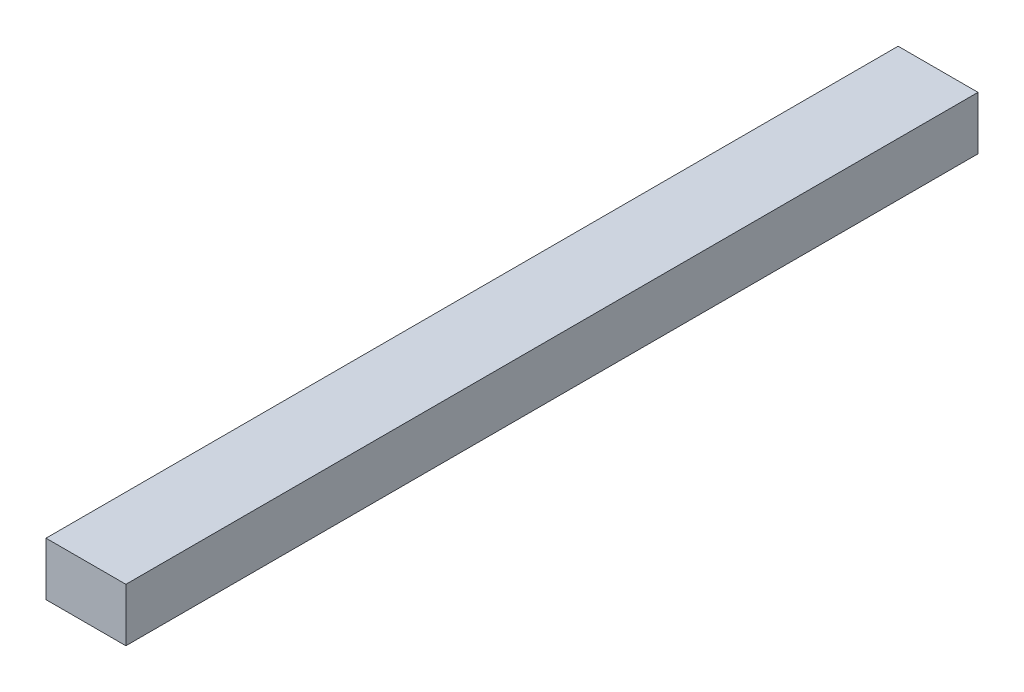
ISO-10303-21;
HEADER;
FILE_DESCRIPTION(('STEP AP214'),'2;1');
FILE_NAME('part.step','',(''),(''),'','','');
FILE_SCHEMA(('AUTOMOTIVE_DESIGN { 1 0 10303 214 1 1 1 1 }'));
ENDSEC;
DATA;
#1=APPLICATION_CONTEXT('core data for automotive mechanical design processes');
#2=APPLICATION_PROTOCOL_DEFINITION('international standard','automotive_design',2000,#1);
#3=PRODUCT_CONTEXT('',#1,'mechanical');
#4=PRODUCT('Part','Part','',(#3));
#5=PRODUCT_RELATED_PRODUCT_CATEGORY('part','',(#4));
#6=PRODUCT_DEFINITION_FORMATION('','',#4);
#7=PRODUCT_DEFINITION_CONTEXT('part definition',#1,'design');
#8=PRODUCT_DEFINITION('design','',#6,#7);
#9=PRODUCT_DEFINITION_SHAPE('','',#8);
#10=(LENGTH_UNIT() NAMED_UNIT(*) SI_UNIT(.MILLI.,.METRE.));
#11=(NAMED_UNIT(*) PLANE_ANGLE_UNIT() SI_UNIT($,.RADIAN.));
#12=(NAMED_UNIT(*) SI_UNIT($,.STERADIAN.) SOLID_ANGLE_UNIT());
#13=UNCERTAINTY_MEASURE_WITH_UNIT(LENGTH_MEASURE(1.E-05),#10,'distance_accuracy_value','');
#14=(GEOMETRIC_REPRESENTATION_CONTEXT(3) GLOBAL_UNCERTAINTY_ASSIGNED_CONTEXT((#13)) GLOBAL_UNIT_ASSIGNED_CONTEXT((#10,
#11,#12)) REPRESENTATION_CONTEXT('',''));
#15=CARTESIAN_POINT('',(0.,0.,0.));
#16=DIRECTION('',(0.,0.,1.));
#17=DIRECTION('',(1.,0.,0.));
#18=AXIS2_PLACEMENT_3D('',#15,#16,#17);
#19=CARTESIAN_POINT('',(3.,2.,32.));
#20=DIRECTION('',(-1.,0.,0.));
#21=DIRECTION('',(0.,0.,1.));
#22=AXIS2_PLACEMENT_3D('',#19,#20,#21);
#23=PLANE('',#22);
#24=DIRECTION('',(0.,1.,0.));
#25=VECTOR('',#24,1.);
#26=CARTESIAN_POINT('',(3.,2.,-32.));
#27=LINE('',#26,#25);
#28=CARTESIAN_POINT('',(3.,-2.,-32.));
#29=VERTEX_POINT('',#28);
#30=CARTESIAN_POINT('',(3.,2.,-32.));
#31=VERTEX_POINT('',#30);
#32=EDGE_CURVE('E102',#29,#31,#27,.T.);
#33=ORIENTED_EDGE('',*,*,#32,.T.);
#34=DIRECTION('',(0.,0.,-1.));
#35=VECTOR('',#34,1.);
#36=CARTESIAN_POINT('',(3.,2.,32.));
#37=LINE('',#36,#35);
#38=CARTESIAN_POINT('',(3.,2.,32.));
#39=VERTEX_POINT('',#38);
#40=EDGE_CURVE('E11',#39,#31,#37,.T.);
#41=ORIENTED_EDGE('',*,*,#40,.F.);
#42=DIRECTION('',(0.,1.,0.));
#43=VECTOR('',#42,1.);
#44=CARTESIAN_POINT('',(3.,2.,32.));
#45=LINE('',#44,#43);
#46=CARTESIAN_POINT('',(3.,-2.,32.));
#47=VERTEX_POINT('',#46);
#48=EDGE_CURVE('E90',#47,#39,#45,.T.);
#49=ORIENTED_EDGE('',*,*,#48,.F.);
#50=DIRECTION('',(0.,0.,-1.));
#51=VECTOR('',#50,1.);
#52=CARTESIAN_POINT('',(3.,-2.,32.));
#53=LINE('',#52,#51);
#54=EDGE_CURVE('E98',#47,#29,#53,.T.);
#55=ORIENTED_EDGE('',*,*,#54,.T.);
#56=EDGE_LOOP('',(#33,#41,#49,#55));
#57=FACE_BOUND('',#56,.T.);
#58=ADVANCED_FACE('F39',(#57),#23,.F.);
#59=CARTESIAN_POINT('',(-3.,2.,32.));
#60=DIRECTION('',(0.,-1.,0.));
#61=DIRECTION('',(0.,0.,-1.));
#62=AXIS2_PLACEMENT_3D('',#59,#60,#61);
#63=PLANE('',#62);
#64=DIRECTION('',(-1.,0.,0.));
#65=VECTOR('',#64,1.);
#66=CARTESIAN_POINT('',(-3.,2.,-32.));
#67=LINE('',#66,#65);
#68=CARTESIAN_POINT('',(-3.,2.,-32.));
#69=VERTEX_POINT('',#68);
#70=EDGE_CURVE('E94',#31,#69,#67,.T.);
#71=ORIENTED_EDGE('',*,*,#70,.T.);
#72=DIRECTION('',(0.,0.,-1.));
#73=VECTOR('',#72,1.);
#74=CARTESIAN_POINT('',(-3.,2.,32.));
#75=LINE('',#74,#73);
#76=CARTESIAN_POINT('',(-3.,2.,32.));
#77=VERTEX_POINT('',#76);
#78=EDGE_CURVE('E47',#77,#69,#75,.T.);
#79=ORIENTED_EDGE('',*,*,#78,.F.);
#80=DIRECTION('',(-1.,0.,0.));
#81=VECTOR('',#80,1.);
#82=CARTESIAN_POINT('',(-3.,2.,32.));
#83=LINE('',#82,#81);
#84=EDGE_CURVE('E85',#39,#77,#83,.T.);
#85=ORIENTED_EDGE('',*,*,#84,.F.);
#86=ORIENTED_EDGE('',*,*,#40,.T.);
#87=EDGE_LOOP('',(#71,#79,#85,#86));
#88=FACE_BOUND('',#87,.T.);
#89=ADVANCED_FACE('F93',(#88),#63,.F.);
#90=CARTESIAN_POINT('',(-3.,2.,32.));
#91=DIRECTION('',(1.,0.,0.));
#92=DIRECTION('',(0.,0.,-1.));
#93=AXIS2_PLACEMENT_3D('',#90,#91,#92);
#94=PLANE('',#93);
#95=DIRECTION('',(0.,-1.,0.));
#96=VECTOR('',#95,1.);
#97=CARTESIAN_POINT('',(-3.,2.,-32.));
#98=LINE('',#97,#96);
#99=CARTESIAN_POINT('',(-3.,-2.,-32.));
#100=VERTEX_POINT('',#99);
#101=EDGE_CURVE('E72',#69,#100,#98,.T.);
#102=ORIENTED_EDGE('',*,*,#101,.T.);
#103=DIRECTION('',(0.,0.,-1.));
#104=VECTOR('',#103,1.);
#105=CARTESIAN_POINT('',(-3.,-2.,32.));
#106=LINE('',#105,#104);
#107=CARTESIAN_POINT('',(-3.,-2.,32.));
#108=VERTEX_POINT('',#107);
#109=EDGE_CURVE('E95',#108,#100,#106,.T.);
#110=ORIENTED_EDGE('',*,*,#109,.F.);
#111=DIRECTION('',(0.,-1.,0.));
#112=VECTOR('',#111,1.);
#113=CARTESIAN_POINT('',(-3.,2.,32.));
#114=LINE('',#113,#112);
#115=EDGE_CURVE('E88',#77,#108,#114,.T.);
#116=ORIENTED_EDGE('',*,*,#115,.F.);
#117=ORIENTED_EDGE('',*,*,#78,.T.);
#118=EDGE_LOOP('',(#102,#110,#116,#117));
#119=FACE_BOUND('',#118,.T.);
#120=ADVANCED_FACE('F96',(#119),#94,.F.);
#121=CARTESIAN_POINT('',(-3.,-2.,32.));
#122=DIRECTION('',(0.,1.,0.));
#123=DIRECTION('',(0.,0.,1.));
#124=AXIS2_PLACEMENT_3D('',#121,#122,#123);
#125=PLANE('',#124);
#126=DIRECTION('',(1.,0.,0.));
#127=VECTOR('',#126,1.);
#128=CARTESIAN_POINT('',(-3.,-2.,-32.));
#129=LINE('',#128,#127);
#130=EDGE_CURVE('E78',#100,#29,#129,.T.);
#131=ORIENTED_EDGE('',*,*,#130,.T.);
#132=ORIENTED_EDGE('',*,*,#54,.F.);
#133=DIRECTION('',(1.,0.,0.));
#134=VECTOR('',#133,1.);
#135=CARTESIAN_POINT('',(-3.,-2.,32.));
#136=LINE('',#135,#134);
#137=EDGE_CURVE('E55',#108,#47,#136,.T.);
#138=ORIENTED_EDGE('',*,*,#137,.F.);
#139=ORIENTED_EDGE('',*,*,#109,.T.);
#140=EDGE_LOOP('',(#131,#132,#138,#139));
#141=FACE_BOUND('',#140,.T.);
#142=ADVANCED_FACE('F109',(#141),#125,.F.);
#143=CARTESIAN_POINT('',(0.,0.,32.));
#144=DIRECTION('',(0.,0.,1.));
#145=DIRECTION('',(1.,0.,0.));
#146=AXIS2_PLACEMENT_3D('',#143,#144,#145);
#147=PLANE('',#146);
#148=ORIENTED_EDGE('',*,*,#48,.T.);
#149=ORIENTED_EDGE('',*,*,#84,.T.);
#150=ORIENTED_EDGE('',*,*,#115,.T.);
#151=ORIENTED_EDGE('',*,*,#137,.T.);
#152=EDGE_LOOP('',(#148,#149,#150,#151));
#153=FACE_BOUND('',#152,.T.);
#154=ADVANCED_FACE('F86',(#153),#147,.T.);
#155=CARTESIAN_POINT('',(0.,0.,-32.));
#156=DIRECTION('',(0.,0.,1.));
#157=DIRECTION('',(1.,0.,0.));
#158=AXIS2_PLACEMENT_3D('',#155,#156,#157);
#159=PLANE('',#158);
#160=ORIENTED_EDGE('',*,*,#32,.F.);
#161=ORIENTED_EDGE('',*,*,#130,.F.);
#162=ORIENTED_EDGE('',*,*,#101,.F.);
#163=ORIENTED_EDGE('',*,*,#70,.F.);
#164=EDGE_LOOP('',(#160,#161,#162,#163));
#165=FACE_BOUND('',#164,.T.);
#166=ADVANCED_FACE('F112',(#165),#159,.F.);
#167=CLOSED_SHELL('',(#58,#89,#120,#142,#154,#166));
#168=MANIFOLD_SOLID_BREP('B2',#167);
#169=ADVANCED_BREP_SHAPE_REPRESENTATION('',(#18,#168),#14);
#170=SHAPE_DEFINITION_REPRESENTATION(#9,#169);
ENDSEC;
END-ISO-10303-21;
